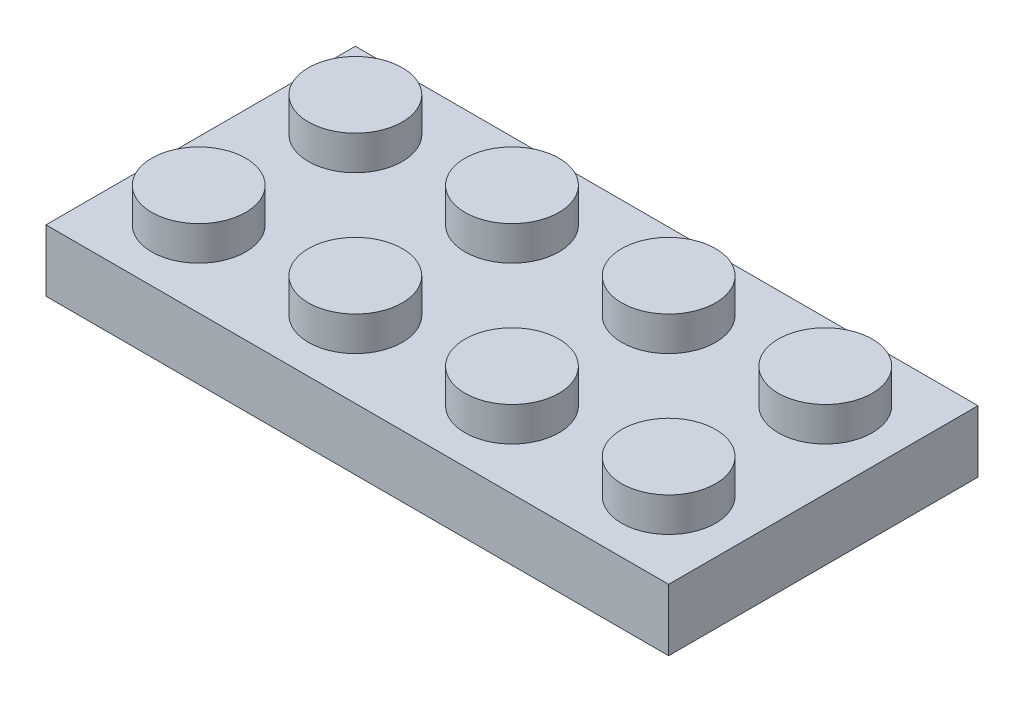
from build123d import *

# Parameters (mm, degrees)
SKETCH1_W       = 31.8
SKETCH1_H       = 15.8
EXTRUDE1_DEPTH  = 3.16
SKETCH2_R       = 2.4
EXTRUDE2_DEPTH  = 1.75
SKETCH5_W       = 30.8
SKETCH5_H       = 14.8
EXTRUDE4_DEPTH  = 2.5
SKETCH6_R       = 3.4
EXTRUDE5_DEPTH  = 2.5
LPATTERN1_COUNT = 4
LPATTERN1_PITCH = 8
LPATTERN3_COUNT = 3
LPATTERN3_PITCH = 8


with BuildPart() as part:
    # Sketch1 → Extrude1 (new body)
    with BuildSketch(Plane(origin=(0, 0, 0), x_dir=(1, 0, 0), z_dir=(0, 1, 0))):
        Rectangle(SKETCH1_W, SKETCH1_H)
    extrude(amount=EXTRUDE1_DEPTH)

    # Sketch2 → Extrude2 (add)
    with BuildSketch(Plane(origin=(0, 3.16, 0), x_dir=(1, 0, 0), z_dir=(0, 1, 0))):
        with Locations(Location((12, 4, 0), (0, 0, 270))):
            Circle(SKETCH2_R)
        with Locations(Location((12, -4, 0), (0, 0, 270))):
            Circle(SKETCH2_R)
    extrude2 = extrude(amount=EXTRUDE2_DEPTH)

    # Sketch5 → Extrude4 (cut)
    with BuildSketch(Plane.XZ):
        Rectangle(SKETCH5_W, SKETCH5_H)
    extrude(amount=-EXTRUDE4_DEPTH, mode=Mode.SUBTRACT)

    # Sketch6 → Extrude5 (add)
    with BuildSketch(Plane.XZ.offset(-2.5)):
        with Locations(Location((7.9, 0, 0), (0, 0, 270))):
            Circle(SKETCH6_R)
    extrude5 = extrude(amount=EXTRUDE5_DEPTH)

    # LPattern1: Extrude2 ×4
    with Locations(*[(-i * LPATTERN1_PITCH, 0, 0) for i in range(1, LPATTERN1_COUNT)]):
        add(extrude2)

    # LPattern3: Extrude5 ×3
    with Locations(*[(-i * LPATTERN3_PITCH, 0, 0) for i in range(1, LPATTERN3_COUNT)]):
        add(extrude5)


solid = part.part
